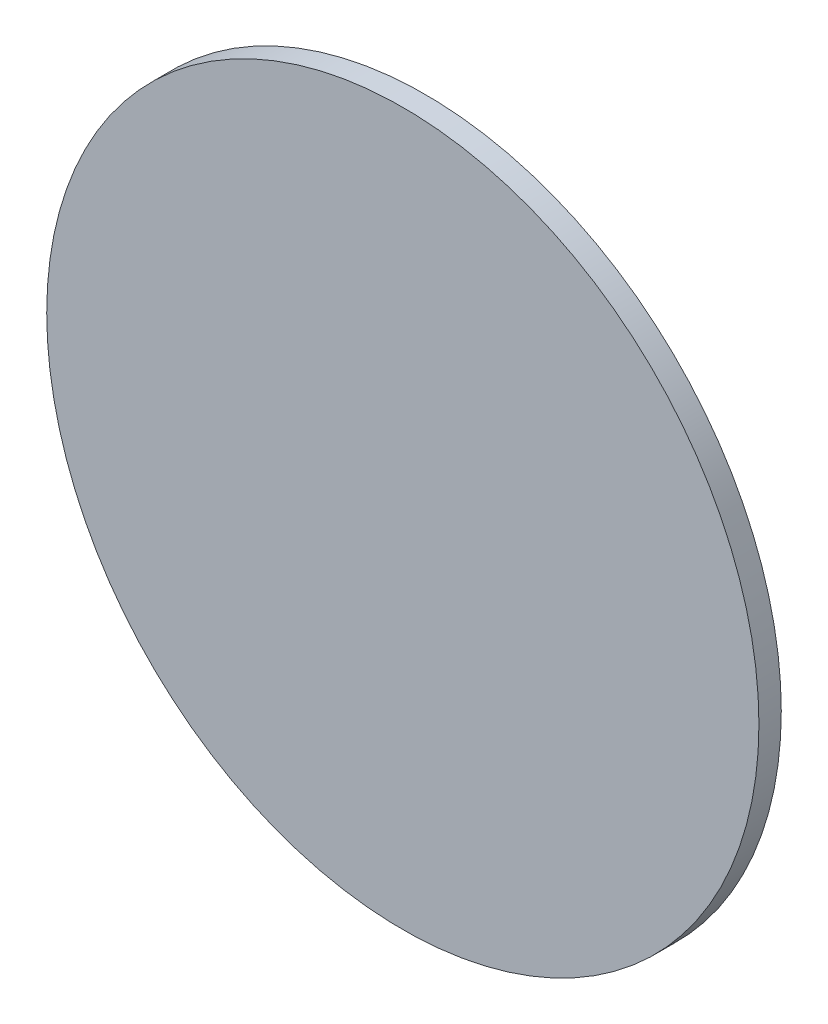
ISO-10303-21;
HEADER;
FILE_DESCRIPTION(('STEP AP214'),'2;1');
FILE_NAME('part.step','',(''),(''),'','','');
FILE_SCHEMA(('AUTOMOTIVE_DESIGN { 1 0 10303 214 1 1 1 1 }'));
ENDSEC;
DATA;
#1=APPLICATION_CONTEXT('core data for automotive mechanical design processes');
#2=APPLICATION_PROTOCOL_DEFINITION('international standard','automotive_design',2000,#1);
#3=PRODUCT_CONTEXT('',#1,'mechanical');
#4=PRODUCT('Part','Part','',(#3));
#5=PRODUCT_RELATED_PRODUCT_CATEGORY('part','',(#4));
#6=PRODUCT_DEFINITION_FORMATION('','',#4);
#7=PRODUCT_DEFINITION_CONTEXT('part definition',#1,'design');
#8=PRODUCT_DEFINITION('design','',#6,#7);
#9=PRODUCT_DEFINITION_SHAPE('','',#8);
#10=(LENGTH_UNIT() NAMED_UNIT(*) SI_UNIT(.MILLI.,.METRE.));
#11=(NAMED_UNIT(*) PLANE_ANGLE_UNIT() SI_UNIT($,.RADIAN.));
#12=(NAMED_UNIT(*) SI_UNIT($,.STERADIAN.) SOLID_ANGLE_UNIT());
#13=UNCERTAINTY_MEASURE_WITH_UNIT(LENGTH_MEASURE(1.E-05),#10,'distance_accuracy_value','');
#14=(GEOMETRIC_REPRESENTATION_CONTEXT(3) GLOBAL_UNCERTAINTY_ASSIGNED_CONTEXT((#13)) GLOBAL_UNIT_ASSIGNED_CONTEXT((#10,
#11,#12)) REPRESENTATION_CONTEXT('',''));
#15=CARTESIAN_POINT('',(0.,0.,0.));
#16=DIRECTION('',(0.,0.,1.));
#17=DIRECTION('',(1.,0.,0.));
#18=AXIS2_PLACEMENT_3D('',#15,#16,#17);
#19=CARTESIAN_POINT('',(0.,0.,22.));
#20=DIRECTION('',(0.,0.,-1.));
#21=DIRECTION('',(-1.,0.,0.));
#22=AXIS2_PLACEMENT_3D('',#19,#20,#21);
#23=CYLINDRICAL_SURFACE('',#22,350.525);
#24=CARTESIAN_POINT('',(0.,0.,22.));
#25=DIRECTION('',(0.,0.,1.));
#26=DIRECTION('',(1.,0.,0.));
#27=AXIS2_PLACEMENT_3D('',#24,#25,#26);
#28=CIRCLE('',#27,350.525);
#29=CARTESIAN_POINT('',(350.525,0.,22.));
#30=VERTEX_POINT('',#29);
#31=EDGE_CURVE('E10',#30,#30,#28,.T.);
#32=ORIENTED_EDGE('',*,*,#31,.F.);
#33=EDGE_LOOP('',(#32));
#34=FACE_BOUND('',#33,.T.);
#35=CARTESIAN_POINT('',(0.,0.,0.));
#36=DIRECTION('',(0.,0.,1.));
#37=DIRECTION('',(1.,0.,0.));
#38=AXIS2_PLACEMENT_3D('',#35,#36,#37);
#39=CIRCLE('',#38,350.525);
#40=CARTESIAN_POINT('',(350.525,0.,0.));
#41=VERTEX_POINT('',#40);
#42=EDGE_CURVE('E33',#41,#41,#39,.T.);
#43=ORIENTED_EDGE('',*,*,#42,.T.);
#44=EDGE_LOOP('',(#43));
#45=FACE_BOUND('',#44,.T.);
#46=ADVANCED_FACE('F30',(#34,#45),#23,.T.);
#47=CARTESIAN_POINT('',(0.,0.,22.));
#48=DIRECTION('',(0.,0.,1.));
#49=DIRECTION('',(1.,0.,0.));
#50=AXIS2_PLACEMENT_3D('',#47,#48,#49);
#51=PLANE('',#50);
#52=ORIENTED_EDGE('',*,*,#31,.T.);
#53=EDGE_LOOP('',(#52));
#54=FACE_BOUND('',#53,.T.);
#55=ADVANCED_FACE('F45',(#54),#51,.T.);
#56=CARTESIAN_POINT('',(0.,0.,0.));
#57=DIRECTION('',(0.,0.,1.));
#58=DIRECTION('',(1.,0.,0.));
#59=AXIS2_PLACEMENT_3D('',#56,#57,#58);
#60=PLANE('',#59);
#61=ORIENTED_EDGE('',*,*,#42,.F.);
#62=EDGE_LOOP('',(#61));
#63=FACE_BOUND('',#62,.T.);
#64=ADVANCED_FACE('F43',(#63),#60,.F.);
#65=CLOSED_SHELL('',(#46,#55,#64));
#66=MANIFOLD_SOLID_BREP('B2',#65);
#67=ADVANCED_BREP_SHAPE_REPRESENTATION('',(#18,#66),#14);
#68=SHAPE_DEFINITION_REPRESENTATION(#9,#67);
ENDSEC;
END-ISO-10303-21;
